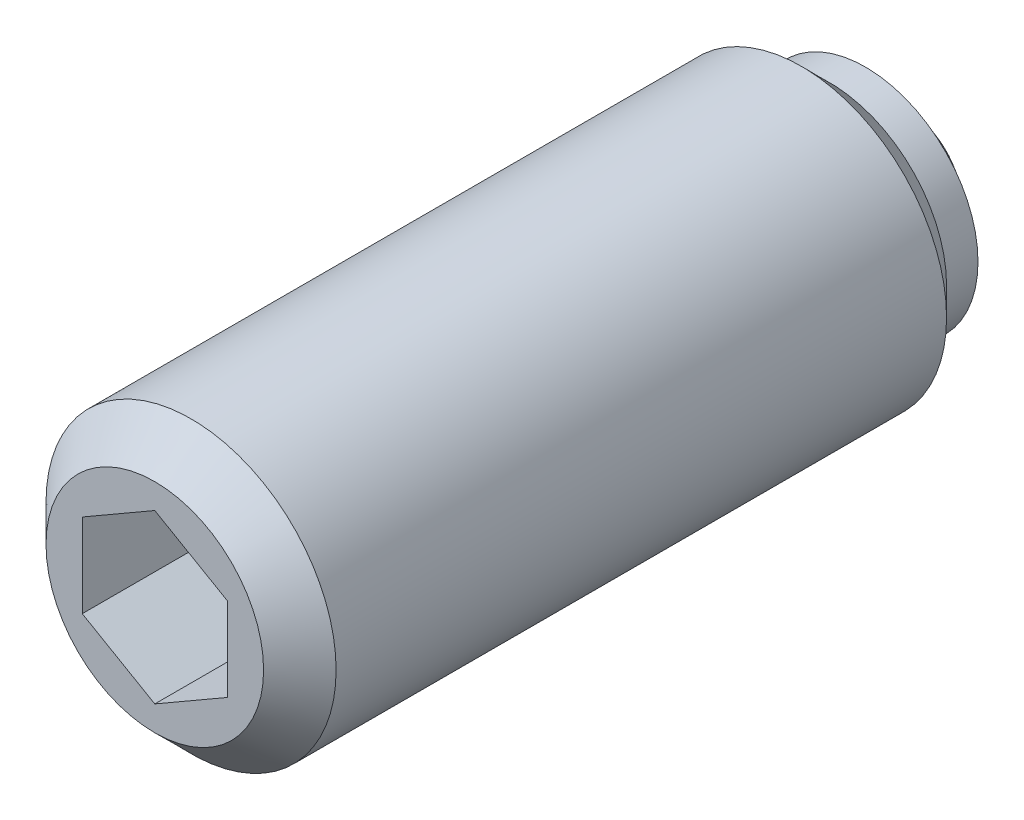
ISO-10303-21;
HEADER;
FILE_DESCRIPTION(('STEP AP214'),'2;1');
FILE_NAME('part.step','',(''),(''),'','','');
FILE_SCHEMA(('AUTOMOTIVE_DESIGN { 1 0 10303 214 1 1 1 1 }'));
ENDSEC;
DATA;
#1=APPLICATION_CONTEXT('core data for automotive mechanical design processes');
#2=APPLICATION_PROTOCOL_DEFINITION('international standard','automotive_design',2000,#1);
#3=PRODUCT_CONTEXT('',#1,'mechanical');
#4=PRODUCT('Part','Part','',(#3));
#5=PRODUCT_RELATED_PRODUCT_CATEGORY('part','',(#4));
#6=PRODUCT_DEFINITION_FORMATION('','',#4);
#7=PRODUCT_DEFINITION_CONTEXT('part definition',#1,'design');
#8=PRODUCT_DEFINITION('design','',#6,#7);
#9=PRODUCT_DEFINITION_SHAPE('','',#8);
#10=(LENGTH_UNIT() NAMED_UNIT(*) SI_UNIT(.MILLI.,.METRE.));
#11=(NAMED_UNIT(*) PLANE_ANGLE_UNIT() SI_UNIT($,.RADIAN.));
#12=(NAMED_UNIT(*) SI_UNIT($,.STERADIAN.) SOLID_ANGLE_UNIT());
#13=UNCERTAINTY_MEASURE_WITH_UNIT(LENGTH_MEASURE(1.E-05),#10,'distance_accuracy_value','');
#14=(GEOMETRIC_REPRESENTATION_CONTEXT(3) GLOBAL_UNCERTAINTY_ASSIGNED_CONTEXT((#13)) GLOBAL_UNIT_ASSIGNED_CONTEXT((#10,
#11,#12)) REPRESENTATION_CONTEXT('',''));
#15=CARTESIAN_POINT('',(0.,0.,0.));
#16=DIRECTION('',(0.,0.,1.));
#17=DIRECTION('',(1.,0.,0.));
#18=AXIS2_PLACEMENT_3D('',#15,#16,#17);
#19=CARTESIAN_POINT('',(0.,0.,18.2));
#20=DIRECTION('',(0.,0.,-1.));
#21=DIRECTION('',(-1.,0.,0.));
#22=AXIS2_PLACEMENT_3D('',#19,#20,#21);
#23=PLANE('',#22);
#24=DIRECTION('',(0.,1.,0.));
#25=VECTOR('',#24,1.);
#26=CARTESIAN_POINT('',(-2.,-1.15470053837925,18.2));
#27=LINE('',#26,#25);
#28=CARTESIAN_POINT('',(-2.,-1.15470053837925,18.2));
#29=VERTEX_POINT('',#28);
#30=CARTESIAN_POINT('',(-2.,1.15470053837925,18.2));
#31=VERTEX_POINT('',#30);
#32=EDGE_CURVE('E80',#29,#31,#27,.T.);
#33=ORIENTED_EDGE('',*,*,#32,.F.);
#34=DIRECTION('',(0.866025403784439,-0.5,0.));
#35=VECTOR('',#34,1.);
#36=CARTESIAN_POINT('',(0.,-2.3094010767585,18.2));
#37=LINE('',#36,#35);
#38=CARTESIAN_POINT('',(0.,-2.3094010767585,18.2));
#39=VERTEX_POINT('',#38);
#40=EDGE_CURVE('E102',#39,#29,#37,.F.);
#41=ORIENTED_EDGE('',*,*,#40,.F.);
#42=DIRECTION('',(-0.866025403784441,-0.5,0.));
#43=VECTOR('',#42,1.);
#44=CARTESIAN_POINT('',(1.,-1.73205080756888,18.2));
#45=LINE('',#44,#43);
#46=CARTESIAN_POINT('',(2.,-1.15470053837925,18.2));
#47=VERTEX_POINT('',#46);
#48=EDGE_CURVE('E81',#47,#39,#45,.T.);
#49=ORIENTED_EDGE('',*,*,#48,.F.);
#50=DIRECTION('',(0.,1.,0.));
#51=VECTOR('',#50,1.);
#52=CARTESIAN_POINT('',(2.,0.,18.2));
#53=LINE('',#52,#51);
#54=CARTESIAN_POINT('',(2.,1.15470053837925,18.2));
#55=VERTEX_POINT('',#54);
#56=EDGE_CURVE('E64',#55,#47,#53,.F.);
#57=ORIENTED_EDGE('',*,*,#56,.F.);
#58=DIRECTION('',(0.866025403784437,-0.5,0.));
#59=VECTOR('',#58,1.);
#60=CARTESIAN_POINT('',(1.,1.73205080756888,18.2));
#61=LINE('',#60,#59);
#62=CARTESIAN_POINT('',(0.,2.3094010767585,18.2));
#63=VERTEX_POINT('',#62);
#64=EDGE_CURVE('E67',#63,#55,#61,.T.);
#65=ORIENTED_EDGE('',*,*,#64,.F.);
#66=DIRECTION('',(0.866025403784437,0.5,0.));
#67=VECTOR('',#66,1.);
#68=CARTESIAN_POINT('',(-2.,1.15470053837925,18.2));
#69=LINE('',#68,#67);
#70=EDGE_CURVE('E69',#31,#63,#69,.T.);
#71=ORIENTED_EDGE('',*,*,#70,.F.);
#72=EDGE_LOOP('',(#33,#41,#49,#57,#65,#71));
#73=FACE_BOUND('',#72,.T.);
#74=ADVANCED_FACE('F14',(#73),#23,.F.);
#75=CARTESIAN_POINT('',(-2.,-1.15470053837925,18.2));
#76=DIRECTION('',(1.,0.,0.));
#77=DIRECTION('',(0.,0.,-1.));
#78=AXIS2_PLACEMENT_3D('',#75,#76,#77);
#79=PLANE('',#78);
#80=ORIENTED_EDGE('',*,*,#32,.T.);
#81=DIRECTION('',(0.,0.,-1.));
#82=VECTOR('',#81,1.);
#83=CARTESIAN_POINT('',(-2.,1.15470053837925,18.2));
#84=LINE('',#83,#82);
#85=CARTESIAN_POINT('',(-2.,1.15470053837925,21.2));
#86=VERTEX_POINT('',#85);
#87=EDGE_CURVE('E79',#86,#31,#84,.T.);
#88=ORIENTED_EDGE('',*,*,#87,.F.);
#89=DIRECTION('',(0.,1.,0.));
#90=VECTOR('',#89,1.);
#91=CARTESIAN_POINT('',(-2.,0.,21.2));
#92=LINE('',#91,#90);
#93=CARTESIAN_POINT('',(-2.,-1.15470053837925,21.2));
#94=VERTEX_POINT('',#93);
#95=EDGE_CURVE('E84',#86,#94,#92,.F.);
#96=ORIENTED_EDGE('',*,*,#95,.T.);
#97=DIRECTION('',(0.,0.,-1.));
#98=VECTOR('',#97,1.);
#99=CARTESIAN_POINT('',(-2.,-1.15470053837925,18.2));
#100=LINE('',#99,#98);
#101=EDGE_CURVE('E96',#29,#94,#100,.F.);
#102=ORIENTED_EDGE('',*,*,#101,.F.);
#103=EDGE_LOOP('',(#80,#88,#96,#102));
#104=FACE_BOUND('',#103,.T.);
#105=ADVANCED_FACE('F169',(#104),#79,.T.);
#106=CARTESIAN_POINT('',(0.,-2.3094010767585,18.2));
#107=DIRECTION('',(0.5,0.866025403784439,0.));
#108=DIRECTION('',(0.866025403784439,-0.5,0.));
#109=AXIS2_PLACEMENT_3D('',#106,#107,#108);
#110=PLANE('',#109);
#111=ORIENTED_EDGE('',*,*,#40,.T.);
#112=ORIENTED_EDGE('',*,*,#101,.T.);
#113=DIRECTION('',(0.866025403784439,-0.5,0.));
#114=VECTOR('',#113,1.);
#115=CARTESIAN_POINT('',(-2.,-1.15470053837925,21.2));
#116=LINE('',#115,#114);
#117=CARTESIAN_POINT('',(0.,-2.3094010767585,21.2));
#118=VERTEX_POINT('',#117);
#119=EDGE_CURVE('E85',#94,#118,#116,.T.);
#120=ORIENTED_EDGE('',*,*,#119,.T.);
#121=DIRECTION('',(0.,0.,-1.));
#122=VECTOR('',#121,1.);
#123=CARTESIAN_POINT('',(0.,-2.3094010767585,18.2));
#124=LINE('',#123,#122);
#125=EDGE_CURVE('E94',#39,#118,#124,.F.);
#126=ORIENTED_EDGE('',*,*,#125,.F.);
#127=EDGE_LOOP('',(#111,#112,#120,#126));
#128=FACE_BOUND('',#127,.T.);
#129=ADVANCED_FACE('F173',(#128),#110,.T.);
#130=CARTESIAN_POINT('',(2.,-1.15470053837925,18.2));
#131=DIRECTION('',(-0.5,0.866025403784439,0.));
#132=DIRECTION('',(0.866025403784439,0.5,0.));
#133=AXIS2_PLACEMENT_3D('',#130,#131,#132);
#134=PLANE('',#133);
#135=ORIENTED_EDGE('',*,*,#48,.T.);
#136=ORIENTED_EDGE('',*,*,#125,.T.);
#137=DIRECTION('',(0.866025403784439,0.5,0.));
#138=VECTOR('',#137,1.);
#139=CARTESIAN_POINT('',(0.,-2.3094010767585,21.2));
#140=LINE('',#139,#138);
#141=CARTESIAN_POINT('',(2.,-1.15470053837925,21.2));
#142=VERTEX_POINT('',#141);
#143=EDGE_CURVE('E108',#118,#142,#140,.T.);
#144=ORIENTED_EDGE('',*,*,#143,.T.);
#145=DIRECTION('',(0.,0.,1.));
#146=VECTOR('',#145,1.);
#147=CARTESIAN_POINT('',(2.,-1.15470053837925,18.2));
#148=LINE('',#147,#146);
#149=EDGE_CURVE('E91',#47,#142,#148,.T.);
#150=ORIENTED_EDGE('',*,*,#149,.F.);
#151=EDGE_LOOP('',(#135,#136,#144,#150));
#152=FACE_BOUND('',#151,.T.);
#153=ADVANCED_FACE('F178',(#152),#134,.T.);
#154=CARTESIAN_POINT('',(2.,1.15470053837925,18.2));
#155=DIRECTION('',(-1.,0.,0.));
#156=DIRECTION('',(0.,0.,1.));
#157=AXIS2_PLACEMENT_3D('',#154,#155,#156);
#158=PLANE('',#157);
#159=ORIENTED_EDGE('',*,*,#56,.T.);
#160=ORIENTED_EDGE('',*,*,#149,.T.);
#161=DIRECTION('',(0.,1.,0.));
#162=VECTOR('',#161,1.);
#163=CARTESIAN_POINT('',(2.,0.,21.2));
#164=LINE('',#163,#162);
#165=CARTESIAN_POINT('',(2.,1.15470053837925,21.2));
#166=VERTEX_POINT('',#165);
#167=EDGE_CURVE('E110',#142,#166,#164,.T.);
#168=ORIENTED_EDGE('',*,*,#167,.T.);
#169=DIRECTION('',(0.,0.,-1.));
#170=VECTOR('',#169,1.);
#171=CARTESIAN_POINT('',(2.,1.15470053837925,18.2));
#172=LINE('',#171,#170);
#173=EDGE_CURVE('E87',#55,#166,#172,.F.);
#174=ORIENTED_EDGE('',*,*,#173,.F.);
#175=EDGE_LOOP('',(#159,#160,#168,#174));
#176=FACE_BOUND('',#175,.T.);
#177=ADVANCED_FACE('F184',(#176),#158,.T.);
#178=CARTESIAN_POINT('',(0.,2.3094010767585,18.2));
#179=DIRECTION('',(-0.5,-0.866025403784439,0.));
#180=DIRECTION('',(-0.866025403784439,0.5,0.));
#181=AXIS2_PLACEMENT_3D('',#178,#179,#180);
#182=PLANE('',#181);
#183=ORIENTED_EDGE('',*,*,#64,.T.);
#184=ORIENTED_EDGE('',*,*,#173,.T.);
#185=DIRECTION('',(-0.866025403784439,0.5,0.));
#186=VECTOR('',#185,1.);
#187=CARTESIAN_POINT('',(2.,1.15470053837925,21.2));
#188=LINE('',#187,#186);
#189=CARTESIAN_POINT('',(0.,2.3094010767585,21.2));
#190=VERTEX_POINT('',#189);
#191=EDGE_CURVE('E31',#166,#190,#188,.T.);
#192=ORIENTED_EDGE('',*,*,#191,.T.);
#193=DIRECTION('',(0.,0.,-1.));
#194=VECTOR('',#193,1.);
#195=CARTESIAN_POINT('',(0.,2.3094010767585,18.2));
#196=LINE('',#195,#194);
#197=EDGE_CURVE('E77',#63,#190,#196,.F.);
#198=ORIENTED_EDGE('',*,*,#197,.F.);
#199=EDGE_LOOP('',(#183,#184,#192,#198));
#200=FACE_BOUND('',#199,.T.);
#201=ADVANCED_FACE('F83',(#200),#182,.T.);
#202=CARTESIAN_POINT('',(-2.,1.15470053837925,18.2));
#203=DIRECTION('',(0.5,-0.866025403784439,0.));
#204=DIRECTION('',(-0.866025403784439,-0.5,0.));
#205=AXIS2_PLACEMENT_3D('',#202,#203,#204);
#206=PLANE('',#205);
#207=ORIENTED_EDGE('',*,*,#70,.T.);
#208=ORIENTED_EDGE('',*,*,#197,.T.);
#209=DIRECTION('',(-0.866025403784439,-0.5,0.));
#210=VECTOR('',#209,1.);
#211=CARTESIAN_POINT('',(0.,2.3094010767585,21.2));
#212=LINE('',#211,#210);
#213=EDGE_CURVE('E113',#190,#86,#212,.T.);
#214=ORIENTED_EDGE('',*,*,#213,.T.);
#215=ORIENTED_EDGE('',*,*,#87,.T.);
#216=EDGE_LOOP('',(#207,#208,#214,#215));
#217=FACE_BOUND('',#216,.T.);
#218=ADVANCED_FACE('F75',(#217),#206,.T.);
#219=CARTESIAN_POINT('',(0.,0.,21.2));
#220=DIRECTION('',(0.,0.,-1.));
#221=DIRECTION('',(-1.,0.,0.));
#222=AXIS2_PLACEMENT_3D('',#219,#220,#221);
#223=PLANE('',#222);
#224=ORIENTED_EDGE('',*,*,#191,.F.);
#225=ORIENTED_EDGE('',*,*,#167,.F.);
#226=ORIENTED_EDGE('',*,*,#143,.F.);
#227=ORIENTED_EDGE('',*,*,#119,.F.);
#228=ORIENTED_EDGE('',*,*,#95,.F.);
#229=ORIENTED_EDGE('',*,*,#213,.F.);
#230=EDGE_LOOP('',(#224,#225,#226,#227,#228,#229));
#231=FACE_BOUND('',#230,.T.);
#232=CARTESIAN_POINT('',(0.,0.,21.1999999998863));
#233=DIRECTION('',(0.,0.,-1.));
#234=DIRECTION('',(-1.,0.,0.));
#235=AXIS2_PLACEMENT_3D('',#232,#233,#234);
#236=CIRCLE('',#235,2.99999999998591);
#237=CARTESIAN_POINT('',(-2.99999999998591,0.,21.1999999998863));
#238=VERTEX_POINT('',#237);
#239=EDGE_CURVE('E17',#238,#238,#236,.T.);
#240=ORIENTED_EDGE('',*,*,#239,.F.);
#241=EDGE_LOOP('',(#240));
#242=FACE_BOUND('',#241,.T.);
#243=ADVANCED_FACE('F193',(#231,#242),#223,.F.);
#244=CARTESIAN_POINT('',(0.,0.,20.2000000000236));
#245=DIRECTION('',(0.,0.,-1.));
#246=DIRECTION('',(-1.,0.,0.));
#247=AXIS2_PLACEMENT_3D('',#244,#245,#246);
#248=CONICAL_SURFACE('',#247,3.99999999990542,0.785398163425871);
#249=ORIENTED_EDGE('',*,*,#239,.T.);
#250=EDGE_LOOP('',(#249));
#251=FACE_BOUND('',#250,.T.);
#252=CARTESIAN_POINT('',(0.,0.,20.2));
#253=DIRECTION('',(0.,0.,1.));
#254=DIRECTION('',(1.,0.,0.));
#255=AXIS2_PLACEMENT_3D('',#252,#253,#254);
#256=CIRCLE('',#255,4.);
#257=CARTESIAN_POINT('',(4.,0.,20.2));
#258=VERTEX_POINT('',#257);
#259=EDGE_CURVE('E9',#258,#258,#256,.F.);
#260=ORIENTED_EDGE('',*,*,#259,.F.);
#261=EDGE_LOOP('',(#260));
#262=FACE_BOUND('',#261,.T.);
#263=ADVANCED_FACE('F165',(#251,#262),#248,.T.);
#264=CARTESIAN_POINT('',(0.,0.,11.6));
#265=DIRECTION('',(0.,0.,1.));
#266=DIRECTION('',(1.,0.,0.));
#267=AXIS2_PLACEMENT_3D('',#264,#265,#266);
#268=CYLINDRICAL_SURFACE('',#267,4.);
#269=ORIENTED_EDGE('',*,*,#259,.T.);
#270=EDGE_LOOP('',(#269));
#271=FACE_BOUND('',#270,.T.);
#272=CARTESIAN_POINT('',(0.,0.,3.36700000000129));
#273=DIRECTION('',(0.,0.,1.));
#274=DIRECTION('',(1.,0.,0.));
#275=AXIS2_PLACEMENT_3D('',#272,#273,#274);
#276=CIRCLE('',#275,4.);
#277=CARTESIAN_POINT('',(4.,0.,3.36700000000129));
#278=VERTEX_POINT('',#277);
#279=EDGE_CURVE('E128',#278,#278,#276,.T.);
#280=ORIENTED_EDGE('',*,*,#279,.T.);
#281=EDGE_LOOP('',(#280));
#282=FACE_BOUND('',#281,.T.);
#283=ADVANCED_FACE('F132',(#271,#282),#268,.T.);
#284=CARTESIAN_POINT('',(0.,0.,2.75));
#285=DIRECTION('',(0.,0.,1.));
#286=DIRECTION('',(0.,1.,0.));
#287=AXIS2_PLACEMENT_3D('',#284,#285,#286);
#288=SPHERICAL_SURFACE('',#287,2.75);
#289=CARTESIAN_POINT('',(0.,0.,1.6));
#290=DIRECTION('',(0.,0.,1.));
#291=DIRECTION('',(1.,0.,0.));
#292=AXIS2_PLACEMENT_3D('',#289,#290,#291);
#293=CIRCLE('',#292,2.49799919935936);
#294=CARTESIAN_POINT('',(2.49799919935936,0.,1.6));
#295=VERTEX_POINT('',#294);
#296=EDGE_CURVE('E71',#295,#295,#293,.T.);
#297=ORIENTED_EDGE('',*,*,#296,.F.);
#298=EDGE_LOOP('',(#297));
#299=FACE_BOUND('',#298,.T.);
#300=ADVANCED_FACE('F155',(#299),#288,.T.);
#301=CARTESIAN_POINT('',(0.,2.49799919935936,1.6));
#302=DIRECTION('',(0.,0.,1.));
#303=DIRECTION('',(1.,0.,0.));
#304=AXIS2_PLACEMENT_3D('',#301,#302,#303);
#305=PLANE('',#304);
#306=CARTESIAN_POINT('',(0.,0.,1.6));
#307=DIRECTION('',(0.,0.,1.));
#308=DIRECTION('',(1.,0.,0.));
#309=AXIS2_PLACEMENT_3D('',#306,#307,#308);
#310=CIRCLE('',#309,3.10000000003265);
#311=CARTESIAN_POINT('',(3.10000000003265,0.,1.6));
#312=VERTEX_POINT('',#311);
#313=EDGE_CURVE('E119',#312,#312,#310,.T.);
#314=ORIENTED_EDGE('',*,*,#313,.F.);
#315=EDGE_LOOP('',(#314));
#316=FACE_BOUND('',#315,.T.);
#317=ORIENTED_EDGE('',*,*,#296,.T.);
#318=EDGE_LOOP('',(#317));
#319=FACE_BOUND('',#318,.T.);
#320=ADVANCED_FACE('F149',(#316,#319),#305,.F.);
#321=CARTESIAN_POINT('',(0.,0.,24.4785188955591));
#322=DIRECTION('',(0.,0.,1.));
#323=DIRECTION('',(1.,0.,0.));
#324=AXIS2_PLACEMENT_3D('',#321,#322,#323);
#325=CYLINDRICAL_SURFACE('',#324,3.10000000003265);
#326=CARTESIAN_POINT('',(0.,0.,2.6));
#327=DIRECTION('',(0.,0.,1.));
#328=DIRECTION('',(1.,0.,0.));
#329=AXIS2_PLACEMENT_3D('',#326,#327,#328);
#330=CIRCLE('',#329,3.10000000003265);
#331=CARTESIAN_POINT('',(3.10000000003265,0.,2.6));
#332=VERTEX_POINT('',#331);
#333=EDGE_CURVE('E122',#332,#332,#330,.T.);
#334=ORIENTED_EDGE('',*,*,#333,.F.);
#335=EDGE_LOOP('',(#334));
#336=FACE_BOUND('',#335,.T.);
#337=ORIENTED_EDGE('',*,*,#313,.T.);
#338=EDGE_LOOP('',(#337));
#339=FACE_BOUND('',#338,.T.);
#340=ADVANCED_FACE('F143',(#336,#339),#325,.T.);
#341=CARTESIAN_POINT('',(0.,3.10000000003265,2.6));
#342=DIRECTION('',(0.,0.,1.));
#343=DIRECTION('',(1.,0.,0.));
#344=AXIS2_PLACEMENT_3D('',#341,#342,#343);
#345=PLANE('',#344);
#346=CARTESIAN_POINT('',(0.,0.,2.6));
#347=DIRECTION('',(0.,0.,1.));
#348=DIRECTION('',(1.,0.,0.));
#349=AXIS2_PLACEMENT_3D('',#346,#347,#348);
#350=CIRCLE('',#349,3.23299999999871);
#351=CARTESIAN_POINT('',(3.23299999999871,0.,2.6));
#352=VERTEX_POINT('',#351);
#353=EDGE_CURVE('E125',#352,#352,#350,.T.);
#354=ORIENTED_EDGE('',*,*,#353,.F.);
#355=EDGE_LOOP('',(#354));
#356=FACE_BOUND('',#355,.T.);
#357=ORIENTED_EDGE('',*,*,#333,.T.);
#358=EDGE_LOOP('',(#357));
#359=FACE_BOUND('',#358,.T.);
#360=ADVANCED_FACE('F137',(#356,#359),#345,.F.);
#361=CARTESIAN_POINT('',(0.,0.,2.6));
#362=DIRECTION('',(0.,0.,1.));
#363=DIRECTION('',(1.,0.,0.));
#364=AXIS2_PLACEMENT_3D('',#361,#362,#363);
#365=CONICAL_SURFACE('',#364,3.23299999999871,0.785398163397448);
#366=ORIENTED_EDGE('',*,*,#279,.F.);
#367=EDGE_LOOP('',(#366));
#368=FACE_BOUND('',#367,.T.);
#369=ORIENTED_EDGE('',*,*,#353,.T.);
#370=EDGE_LOOP('',(#369));
#371=FACE_BOUND('',#370,.T.);
#372=ADVANCED_FACE('F134',(#368,#371),#365,.T.);
#373=CLOSED_SHELL('',(#74,#105,#129,#153,#177,#201,#218,#243,#263,#283,#300,#320,#340,#360,#372));
#374=MANIFOLD_SOLID_BREP('B1',#373);
#375=ADVANCED_BREP_SHAPE_REPRESENTATION('',(#18,#374),#14);
#376=SHAPE_DEFINITION_REPRESENTATION(#9,#375);
ENDSEC;
END-ISO-10303-21;
